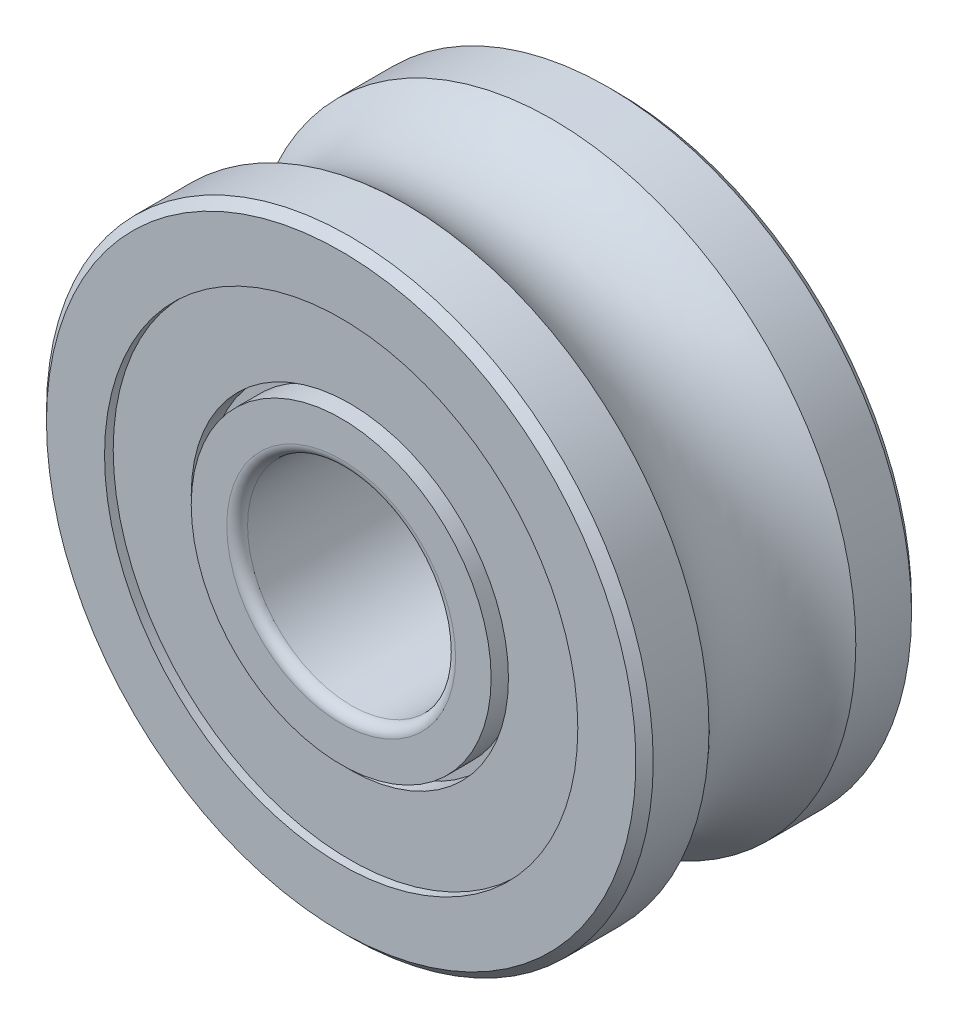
ISO-10303-21;
HEADER;
FILE_DESCRIPTION(('STEP AP214'),'2;1');
FILE_NAME('part.step','',(''),(''),'','','');
FILE_SCHEMA(('AUTOMOTIVE_DESIGN { 1 0 10303 214 1 1 1 1 }'));
ENDSEC;
DATA;
#1=APPLICATION_CONTEXT('core data for automotive mechanical design processes');
#2=APPLICATION_PROTOCOL_DEFINITION('international standard','automotive_design',2000,#1);
#3=PRODUCT_CONTEXT('',#1,'mechanical');
#4=PRODUCT('Part','Part','',(#3));
#5=PRODUCT_RELATED_PRODUCT_CATEGORY('part','',(#4));
#6=PRODUCT_DEFINITION_FORMATION('','',#4);
#7=PRODUCT_DEFINITION_CONTEXT('part definition',#1,'design');
#8=PRODUCT_DEFINITION('design','',#6,#7);
#9=PRODUCT_DEFINITION_SHAPE('','',#8);
#10=(LENGTH_UNIT() NAMED_UNIT(*) SI_UNIT(.MILLI.,.METRE.));
#11=(NAMED_UNIT(*) PLANE_ANGLE_UNIT() SI_UNIT($,.RADIAN.));
#12=(NAMED_UNIT(*) SI_UNIT($,.STERADIAN.) SOLID_ANGLE_UNIT());
#13=UNCERTAINTY_MEASURE_WITH_UNIT(LENGTH_MEASURE(1.E-05),#10,'distance_accuracy_value','');
#14=(GEOMETRIC_REPRESENTATION_CONTEXT(3) GLOBAL_UNCERTAINTY_ASSIGNED_CONTEXT((#13)) GLOBAL_UNIT_ASSIGNED_CONTEXT((#10,
#11,#12)) REPRESENTATION_CONTEXT('',''));
#15=CARTESIAN_POINT('',(0.,0.,0.));
#16=DIRECTION('',(0.,0.,1.));
#17=DIRECTION('',(1.,0.,0.));
#18=AXIS2_PLACEMENT_3D('',#15,#16,#17);
#19=CARTESIAN_POINT('',(0.,8.65,6.45));
#20=DIRECTION('',(0.,0.,-1.));
#21=DIRECTION('',(-1.,0.,0.));
#22=AXIS2_PLACEMENT_3D('',#19,#20,#21);
#23=PLANE('',#22);
#24=CARTESIAN_POINT('',(0.,0.,6.45));
#25=DIRECTION('',(0.,0.,1.));
#26=DIRECTION('',(1.,0.,0.));
#27=AXIS2_PLACEMENT_3D('',#24,#25,#26);
#28=CIRCLE('',#27,9.15);
#29=CARTESIAN_POINT('',(9.15,0.,6.45));
#30=VERTEX_POINT('',#29);
#31=EDGE_CURVE('E198',#30,#30,#28,.T.);
#32=ORIENTED_EDGE('',*,*,#31,.T.);
#33=EDGE_LOOP('',(#32));
#34=FACE_BOUND('',#33,.T.);
#35=CARTESIAN_POINT('',(0.,0.,6.45));
#36=DIRECTION('',(0.,0.,1.));
#37=DIRECTION('',(1.,0.,0.));
#38=AXIS2_PLACEMENT_3D('',#35,#36,#37);
#39=CIRCLE('',#38,8.65);
#40=CARTESIAN_POINT('',(8.65,0.,6.45));
#41=VERTEX_POINT('',#40);
#42=EDGE_CURVE('E195',#41,#41,#39,.T.);
#43=ORIENTED_EDGE('',*,*,#42,.F.);
#44=EDGE_LOOP('',(#43));
#45=FACE_BOUND('',#44,.T.);
#46=ADVANCED_FACE('F14',(#34,#45),#23,.F.);
#47=CARTESIAN_POINT('',(0.,0.,38.6779652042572));
#48=DIRECTION('',(0.,0.,1.));
#49=DIRECTION('',(1.,0.,0.));
#50=AXIS2_PLACEMENT_3D('',#47,#48,#49);
#51=CYLINDRICAL_SURFACE('',#50,8.65);
#52=CARTESIAN_POINT('',(0.,0.,7.95));
#53=DIRECTION('',(0.,0.,1.));
#54=DIRECTION('',(1.,0.,0.));
#55=AXIS2_PLACEMENT_3D('',#52,#53,#54);
#56=CIRCLE('',#55,8.65);
#57=CARTESIAN_POINT('',(8.65,0.,7.95));
#58=VERTEX_POINT('',#57);
#59=EDGE_CURVE('E201',#58,#58,#56,.F.);
#60=ORIENTED_EDGE('',*,*,#59,.T.);
#61=EDGE_LOOP('',(#60));
#62=FACE_BOUND('',#61,.T.);
#63=ORIENTED_EDGE('',*,*,#42,.T.);
#64=EDGE_LOOP('',(#63));
#65=FACE_BOUND('',#64,.T.);
#66=ADVANCED_FACE('F83',(#62,#65),#51,.T.);
#67=CARTESIAN_POINT('',(0.,0.,38.6779652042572));
#68=DIRECTION('',(0.,0.,1.));
#69=DIRECTION('',(1.,0.,0.));
#70=AXIS2_PLACEMENT_3D('',#67,#68,#69);
#71=CYLINDRICAL_SURFACE('',#70,9.15);
#72=ORIENTED_EDGE('',*,*,#31,.F.);
#73=EDGE_LOOP('',(#72));
#74=FACE_BOUND('',#73,.T.);
#75=CARTESIAN_POINT('',(0.,0.,7.45));
#76=DIRECTION('',(0.,0.,1.));
#77=DIRECTION('',(1.,0.,0.));
#78=AXIS2_PLACEMENT_3D('',#75,#76,#77);
#79=CIRCLE('',#78,9.15);
#80=CARTESIAN_POINT('',(9.15,0.,7.45));
#81=VERTEX_POINT('',#80);
#82=EDGE_CURVE('E54',#81,#81,#79,.T.);
#83=ORIENTED_EDGE('',*,*,#82,.T.);
#84=EDGE_LOOP('',(#83));
#85=FACE_BOUND('',#84,.T.);
#86=ADVANCED_FACE('F72',(#74,#85),#71,.F.);
#87=CARTESIAN_POINT('',(0.,8.65,7.95));
#88=DIRECTION('',(0.,0.,-1.));
#89=DIRECTION('',(-1.,0.,0.));
#90=AXIS2_PLACEMENT_3D('',#87,#88,#89);
#91=PLANE('',#90);
#92=ORIENTED_EDGE('',*,*,#59,.F.);
#93=EDGE_LOOP('',(#92));
#94=FACE_BOUND('',#93,.T.);
#95=CARTESIAN_POINT('',(0.,0.,7.95));
#96=DIRECTION('',(0.,0.,1.));
#97=DIRECTION('',(-1.,0.,0.));
#98=AXIS2_PLACEMENT_3D('',#95,#96,#97);
#99=CIRCLE('',#98,6.6);
#100=CARTESIAN_POINT('',(-6.6,0.,7.95));
#101=VERTEX_POINT('',#100);
#102=CARTESIAN_POINT('',(6.6,0.,7.95));
#103=VERTEX_POINT('',#102);
#104=EDGE_CURVE('E42',#101,#103,#99,.T.);
#105=ORIENTED_EDGE('',*,*,#104,.F.);
#106=CARTESIAN_POINT('',(0.,0.,7.95));
#107=DIRECTION('',(0.,0.,1.));
#108=DIRECTION('',(1.,0.,0.));
#109=AXIS2_PLACEMENT_3D('',#106,#107,#108);
#110=CIRCLE('',#109,6.6);
#111=EDGE_CURVE('E44',#103,#101,#110,.T.);
#112=ORIENTED_EDGE('',*,*,#111,.F.);
#113=EDGE_LOOP('',(#105,#112));
#114=FACE_BOUND('',#113,.T.);
#115=ADVANCED_FACE('F53',(#94,#114),#91,.F.);
#116=CARTESIAN_POINT('',(0.,13.65,7.45));
#117=DIRECTION('',(0.,0.,-1.));
#118=DIRECTION('',(-1.,0.,0.));
#119=AXIS2_PLACEMENT_3D('',#116,#117,#118);
#120=PLANE('',#119);
#121=CARTESIAN_POINT('',(0.,0.,7.45));
#122=DIRECTION('',(0.,0.,1.));
#123=DIRECTION('',(1.,0.,0.));
#124=AXIS2_PLACEMENT_3D('',#121,#122,#123);
#125=CIRCLE('',#124,13.65);
#126=CARTESIAN_POINT('',(13.65,0.,7.45));
#127=VERTEX_POINT('',#126);
#128=EDGE_CURVE('E49',#127,#127,#125,.T.);
#129=ORIENTED_EDGE('',*,*,#128,.T.);
#130=EDGE_LOOP('',(#129));
#131=FACE_BOUND('',#130,.T.);
#132=ORIENTED_EDGE('',*,*,#82,.F.);
#133=EDGE_LOOP('',(#132));
#134=FACE_BOUND('',#133,.T.);
#135=ADVANCED_FACE('F71',(#131,#134),#120,.F.);
#136=CARTESIAN_POINT('',(0.,0.,7.35));
#137=DIRECTION('',(0.,0.,1.));
#138=DIRECTION('',(1.,0.,0.));
#139=AXIS2_PLACEMENT_3D('',#136,#137,#138);
#140=TOROIDAL_SURFACE('',#139,6.6,0.6);
#141=CARTESIAN_POINT('',(0.,0.,7.35));
#142=DIRECTION('',(0.,0.,1.));
#143=DIRECTION('',(1.,0.,0.));
#144=AXIS2_PLACEMENT_3D('',#141,#142,#143);
#145=CIRCLE('',#144,6.);
#146=CARTESIAN_POINT('',(6.,0.,7.35));
#147=VERTEX_POINT('',#146);
#148=EDGE_CURVE('E207',#147,#147,#145,.F.);
#149=ORIENTED_EDGE('',*,*,#148,.T.);
#150=EDGE_LOOP('',(#149));
#151=FACE_BOUND('',#150,.T.);
#152=ORIENTED_EDGE('',*,*,#111,.T.);
#153=ORIENTED_EDGE('',*,*,#104,.T.);
#154=EDGE_LOOP('',(#152,#153));
#155=FACE_BOUND('',#154,.T.);
#156=ADVANCED_FACE('F46',(#151,#155),#140,.T.);
#157=CARTESIAN_POINT('',(0.,0.,38.6779652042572));
#158=DIRECTION('',(0.,0.,1.));
#159=DIRECTION('',(1.,0.,0.));
#160=AXIS2_PLACEMENT_3D('',#157,#158,#159);
#161=CYLINDRICAL_SURFACE('',#160,13.65);
#162=ORIENTED_EDGE('',*,*,#128,.F.);
#163=EDGE_LOOP('',(#162));
#164=FACE_BOUND('',#163,.T.);
#165=CARTESIAN_POINT('',(0.,0.,7.95));
#166=DIRECTION('',(0.,0.,1.));
#167=DIRECTION('',(1.,0.,0.));
#168=AXIS2_PLACEMENT_3D('',#165,#166,#167);
#169=CIRCLE('',#168,13.65);
#170=CARTESIAN_POINT('',(13.65,0.,7.95));
#171=VERTEX_POINT('',#170);
#172=EDGE_CURVE('E208',#171,#171,#169,.T.);
#173=ORIENTED_EDGE('',*,*,#172,.T.);
#174=EDGE_LOOP('',(#173));
#175=FACE_BOUND('',#174,.T.);
#176=ADVANCED_FACE('F240',(#164,#175),#161,.F.);
#177=CARTESIAN_POINT('',(0.,0.,38.6779652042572));
#178=DIRECTION('',(0.,0.,1.));
#179=DIRECTION('',(1.,0.,0.));
#180=AXIS2_PLACEMENT_3D('',#177,#178,#179);
#181=CYLINDRICAL_SURFACE('',#180,6.);
#182=CARTESIAN_POINT('',(0.,0.,-7.35));
#183=DIRECTION('',(0.,0.,1.));
#184=DIRECTION('',(1.,0.,0.));
#185=AXIS2_PLACEMENT_3D('',#182,#183,#184);
#186=CIRCLE('',#185,6.);
#187=CARTESIAN_POINT('',(6.,0.,-7.35));
#188=VERTEX_POINT('',#187);
#189=EDGE_CURVE('E211',#188,#188,#186,.T.);
#190=ORIENTED_EDGE('',*,*,#189,.F.);
#191=EDGE_LOOP('',(#190));
#192=FACE_BOUND('',#191,.T.);
#193=ORIENTED_EDGE('',*,*,#148,.F.);
#194=EDGE_LOOP('',(#193));
#195=FACE_BOUND('',#194,.T.);
#196=ADVANCED_FACE('F244',(#192,#195),#181,.F.);
#197=CARTESIAN_POINT('',(0.,17.,7.95));
#198=DIRECTION('',(0.,0.,-1.));
#199=DIRECTION('',(-1.,0.,0.));
#200=AXIS2_PLACEMENT_3D('',#197,#198,#199);
#201=PLANE('',#200);
#202=CARTESIAN_POINT('',(0.,0.,7.95));
#203=DIRECTION('',(0.,0.,-1.));
#204=DIRECTION('',(-1.,0.,0.));
#205=AXIS2_PLACEMENT_3D('',#202,#203,#204);
#206=CIRCLE('',#205,17.);
#207=CARTESIAN_POINT('',(-17.,0.,7.95));
#208=VERTEX_POINT('',#207);
#209=EDGE_CURVE('E212',#208,#208,#206,.T.);
#210=ORIENTED_EDGE('',*,*,#209,.F.);
#211=EDGE_LOOP('',(#210));
#212=FACE_BOUND('',#211,.T.);
#213=ORIENTED_EDGE('',*,*,#172,.F.);
#214=EDGE_LOOP('',(#213));
#215=FACE_BOUND('',#214,.T.);
#216=ADVANCED_FACE('F178',(#212,#215),#201,.F.);
#217=CARTESIAN_POINT('',(0.,0.,-7.35));
#218=DIRECTION('',(0.,0.,1.));
#219=DIRECTION('',(1.,0.,0.));
#220=AXIS2_PLACEMENT_3D('',#217,#218,#219);
#221=TOROIDAL_SURFACE('',#220,6.6,0.6);
#222=CARTESIAN_POINT('',(0.,0.,-7.95));
#223=DIRECTION('',(0.,0.,-1.));
#224=DIRECTION('',(1.,0.,0.));
#225=AXIS2_PLACEMENT_3D('',#222,#223,#224);
#226=CIRCLE('',#225,6.6);
#227=CARTESIAN_POINT('',(6.6,0.,-7.95));
#228=VERTEX_POINT('',#227);
#229=CARTESIAN_POINT('',(-6.6,0.,-7.95));
#230=VERTEX_POINT('',#229);
#231=EDGE_CURVE('E141',#228,#230,#226,.T.);
#232=ORIENTED_EDGE('',*,*,#231,.T.);
#233=CARTESIAN_POINT('',(0.,0.,-7.95));
#234=DIRECTION('',(0.,0.,-1.));
#235=DIRECTION('',(-1.,0.,0.));
#236=AXIS2_PLACEMENT_3D('',#233,#234,#235);
#237=CIRCLE('',#236,6.6);
#238=EDGE_CURVE('E33',#230,#228,#237,.T.);
#239=ORIENTED_EDGE('',*,*,#238,.T.);
#240=EDGE_LOOP('',(#232,#239));
#241=FACE_BOUND('',#240,.T.);
#242=ORIENTED_EDGE('',*,*,#189,.T.);
#243=EDGE_LOOP('',(#242));
#244=FACE_BOUND('',#243,.T.);
#245=ADVANCED_FACE('F174',(#241,#244),#221,.T.);
#246=CARTESIAN_POINT('',(0.,0.,7.45));
#247=DIRECTION('',(0.,0.,-1.));
#248=DIRECTION('',(-1.,0.,0.));
#249=AXIS2_PLACEMENT_3D('',#246,#247,#248);
#250=CONICAL_SURFACE('',#249,17.5,0.785398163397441);
#251=CARTESIAN_POINT('',(0.,0.,7.45));
#252=DIRECTION('',(0.,0.,1.));
#253=DIRECTION('',(1.,0.,0.));
#254=AXIS2_PLACEMENT_3D('',#251,#252,#253);
#255=CIRCLE('',#254,17.5);
#256=CARTESIAN_POINT('',(17.5,0.,7.45));
#257=VERTEX_POINT('',#256);
#258=EDGE_CURVE('E163',#257,#257,#255,.F.);
#259=ORIENTED_EDGE('',*,*,#258,.F.);
#260=EDGE_LOOP('',(#259));
#261=FACE_BOUND('',#260,.T.);
#262=ORIENTED_EDGE('',*,*,#209,.T.);
#263=EDGE_LOOP('',(#262));
#264=FACE_BOUND('',#263,.T.);
#265=ADVANCED_FACE('F157',(#261,#264),#250,.T.);
#266=CARTESIAN_POINT('',(0.,8.65,-7.95));
#267=DIRECTION('',(0.,0.,1.));
#268=DIRECTION('',(1.,0.,0.));
#269=AXIS2_PLACEMENT_3D('',#266,#267,#268);
#270=PLANE('',#269);
#271=ORIENTED_EDGE('',*,*,#231,.F.);
#272=ORIENTED_EDGE('',*,*,#238,.F.);
#273=EDGE_LOOP('',(#271,#272));
#274=FACE_BOUND('',#273,.T.);
#275=CARTESIAN_POINT('',(0.,0.,-7.95));
#276=DIRECTION('',(0.,0.,1.));
#277=DIRECTION('',(1.,0.,0.));
#278=AXIS2_PLACEMENT_3D('',#275,#276,#277);
#279=CIRCLE('',#278,8.65);
#280=CARTESIAN_POINT('',(8.65,0.,-7.95));
#281=VERTEX_POINT('',#280);
#282=EDGE_CURVE('E139',#281,#281,#279,.T.);
#283=ORIENTED_EDGE('',*,*,#282,.F.);
#284=EDGE_LOOP('',(#283));
#285=FACE_BOUND('',#284,.T.);
#286=ADVANCED_FACE('F146',(#274,#285),#270,.F.);
#287=CARTESIAN_POINT('',(0.,0.,38.6779652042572));
#288=DIRECTION('',(0.,0.,1.));
#289=DIRECTION('',(1.,0.,0.));
#290=AXIS2_PLACEMENT_3D('',#287,#288,#289);
#291=CYLINDRICAL_SURFACE('',#290,17.5);
#292=ORIENTED_EDGE('',*,*,#258,.T.);
#293=EDGE_LOOP('',(#292));
#294=FACE_BOUND('',#293,.T.);
#295=CARTESIAN_POINT('',(0.,0.,4.23526858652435));
#296=DIRECTION('',(0.,0.,1.));
#297=DIRECTION('',(1.,0.,0.));
#298=AXIS2_PLACEMENT_3D('',#295,#296,#297);
#299=CIRCLE('',#298,17.5);
#300=CARTESIAN_POINT('',(17.5,0.,4.23526858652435));
#301=VERTEX_POINT('',#300);
#302=EDGE_CURVE('E135',#301,#301,#299,.T.);
#303=ORIENTED_EDGE('',*,*,#302,.T.);
#304=EDGE_LOOP('',(#303));
#305=FACE_BOUND('',#304,.T.);
#306=ADVANCED_FACE('F156',(#294,#305),#291,.T.);
#307=CARTESIAN_POINT('',(0.,0.,38.6779652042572));
#308=DIRECTION('',(0.,0.,1.));
#309=DIRECTION('',(1.,0.,0.));
#310=AXIS2_PLACEMENT_3D('',#307,#308,#309);
#311=CYLINDRICAL_SURFACE('',#310,8.65);
#312=CARTESIAN_POINT('',(0.,0.,-6.45));
#313=DIRECTION('',(0.,0.,1.));
#314=DIRECTION('',(1.,0.,0.));
#315=AXIS2_PLACEMENT_3D('',#312,#313,#314);
#316=CIRCLE('',#315,8.65);
#317=CARTESIAN_POINT('',(8.65,0.,-6.45));
#318=VERTEX_POINT('',#317);
#319=EDGE_CURVE('E138',#318,#318,#316,.F.);
#320=ORIENTED_EDGE('',*,*,#319,.T.);
#321=EDGE_LOOP('',(#320));
#322=FACE_BOUND('',#321,.T.);
#323=ORIENTED_EDGE('',*,*,#282,.T.);
#324=EDGE_LOOP('',(#323));
#325=FACE_BOUND('',#324,.T.);
#326=ADVANCED_FACE('F273',(#322,#325),#311,.T.);
#327=CARTESIAN_POINT('',(0.,8.65,-6.45));
#328=DIRECTION('',(0.,0.,1.));
#329=DIRECTION('',(1.,0.,0.));
#330=AXIS2_PLACEMENT_3D('',#327,#328,#329);
#331=PLANE('',#330);
#332=ORIENTED_EDGE('',*,*,#319,.F.);
#333=EDGE_LOOP('',(#332));
#334=FACE_BOUND('',#333,.T.);
#335=CARTESIAN_POINT('',(0.,0.,-6.45));
#336=DIRECTION('',(0.,0.,1.));
#337=DIRECTION('',(1.,0.,0.));
#338=AXIS2_PLACEMENT_3D('',#335,#336,#337);
#339=CIRCLE('',#338,9.15);
#340=CARTESIAN_POINT('',(9.15,0.,-6.45));
#341=VERTEX_POINT('',#340);
#342=EDGE_CURVE('E219',#341,#341,#339,.F.);
#343=ORIENTED_EDGE('',*,*,#342,.T.);
#344=EDGE_LOOP('',(#343));
#345=FACE_BOUND('',#344,.T.);
#346=ADVANCED_FACE('F127',(#334,#345),#331,.F.);
#347=CARTESIAN_POINT('',(0.,0.,0.));
#348=DIRECTION('',(0.,0.,1.));
#349=DIRECTION('',(1.,0.,0.));
#350=AXIS2_PLACEMENT_3D('',#347,#348,#349);
#351=TOROIDAL_SURFACE('',#350,21.75,6.);
#352=ORIENTED_EDGE('',*,*,#302,.F.);
#353=EDGE_LOOP('',(#352));
#354=FACE_BOUND('',#353,.T.);
#355=CARTESIAN_POINT('',(0.,0.,-4.23526858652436));
#356=DIRECTION('',(0.,0.,1.));
#357=DIRECTION('',(1.,0.,0.));
#358=AXIS2_PLACEMENT_3D('',#355,#356,#357);
#359=CIRCLE('',#358,17.5);
#360=CARTESIAN_POINT('',(17.5,0.,-4.23526858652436));
#361=VERTEX_POINT('',#360);
#362=EDGE_CURVE('E133',#361,#361,#359,.F.);
#363=ORIENTED_EDGE('',*,*,#362,.F.);
#364=EDGE_LOOP('',(#363));
#365=FACE_BOUND('',#364,.T.);
#366=ADVANCED_FACE('F122',(#354,#365),#351,.F.);
#367=CARTESIAN_POINT('',(0.,0.,38.6779652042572));
#368=DIRECTION('',(0.,0.,1.));
#369=DIRECTION('',(1.,0.,0.));
#370=AXIS2_PLACEMENT_3D('',#367,#368,#369);
#371=CYLINDRICAL_SURFACE('',#370,9.15);
#372=CARTESIAN_POINT('',(0.,0.,-7.45));
#373=DIRECTION('',(0.,0.,1.));
#374=DIRECTION('',(1.,0.,0.));
#375=AXIS2_PLACEMENT_3D('',#372,#373,#374);
#376=CIRCLE('',#375,9.15);
#377=CARTESIAN_POINT('',(9.15,0.,-7.45));
#378=VERTEX_POINT('',#377);
#379=EDGE_CURVE('E222',#378,#378,#376,.F.);
#380=ORIENTED_EDGE('',*,*,#379,.T.);
#381=EDGE_LOOP('',(#380));
#382=FACE_BOUND('',#381,.T.);
#383=ORIENTED_EDGE('',*,*,#342,.F.);
#384=EDGE_LOOP('',(#383));
#385=FACE_BOUND('',#384,.T.);
#386=ADVANCED_FACE('F118',(#382,#385),#371,.F.);
#387=CARTESIAN_POINT('',(0.,0.,38.6779652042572));
#388=DIRECTION('',(0.,0.,1.));
#389=DIRECTION('',(1.,0.,0.));
#390=AXIS2_PLACEMENT_3D('',#387,#388,#389);
#391=CYLINDRICAL_SURFACE('',#390,17.5);
#392=ORIENTED_EDGE('',*,*,#362,.T.);
#393=EDGE_LOOP('',(#392));
#394=FACE_BOUND('',#393,.T.);
#395=CARTESIAN_POINT('',(0.,0.,-7.45));
#396=DIRECTION('',(0.,0.,1.));
#397=DIRECTION('',(1.,0.,0.));
#398=AXIS2_PLACEMENT_3D('',#395,#396,#397);
#399=CIRCLE('',#398,17.5);
#400=CARTESIAN_POINT('',(17.5,0.,-7.45));
#401=VERTEX_POINT('',#400);
#402=EDGE_CURVE('E225',#401,#401,#399,.F.);
#403=ORIENTED_EDGE('',*,*,#402,.F.);
#404=EDGE_LOOP('',(#403));
#405=FACE_BOUND('',#404,.T.);
#406=ADVANCED_FACE('F114',(#394,#405),#391,.T.);
#407=CARTESIAN_POINT('',(0.,13.65,-7.45));
#408=DIRECTION('',(0.,0.,1.));
#409=DIRECTION('',(1.,0.,0.));
#410=AXIS2_PLACEMENT_3D('',#407,#408,#409);
#411=PLANE('',#410);
#412=ORIENTED_EDGE('',*,*,#379,.F.);
#413=EDGE_LOOP('',(#412));
#414=FACE_BOUND('',#413,.T.);
#415=CARTESIAN_POINT('',(0.,0.,-7.45));
#416=DIRECTION('',(0.,0.,1.));
#417=DIRECTION('',(1.,0.,0.));
#418=AXIS2_PLACEMENT_3D('',#415,#416,#417);
#419=CIRCLE('',#418,13.65);
#420=CARTESIAN_POINT('',(13.65,0.,-7.45));
#421=VERTEX_POINT('',#420);
#422=EDGE_CURVE('E226',#421,#421,#419,.F.);
#423=ORIENTED_EDGE('',*,*,#422,.T.);
#424=EDGE_LOOP('',(#423));
#425=FACE_BOUND('',#424,.T.);
#426=ADVANCED_FACE('F110',(#414,#425),#411,.F.);
#427=CARTESIAN_POINT('',(0.,0.,-7.45));
#428=DIRECTION('',(0.,0.,1.));
#429=DIRECTION('',(1.,0.,0.));
#430=AXIS2_PLACEMENT_3D('',#427,#428,#429);
#431=CONICAL_SURFACE('',#430,17.5,0.785398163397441);
#432=ORIENTED_EDGE('',*,*,#402,.T.);
#433=EDGE_LOOP('',(#432));
#434=FACE_BOUND('',#433,.T.);
#435=CARTESIAN_POINT('',(0.,0.,-7.95));
#436=DIRECTION('',(0.,0.,1.));
#437=DIRECTION('',(1.,0.,0.));
#438=AXIS2_PLACEMENT_3D('',#435,#436,#437);
#439=CIRCLE('',#438,17.);
#440=CARTESIAN_POINT('',(17.,0.,-7.95));
#441=VERTEX_POINT('',#440);
#442=EDGE_CURVE('E25',#441,#441,#439,.T.);
#443=ORIENTED_EDGE('',*,*,#442,.T.);
#444=EDGE_LOOP('',(#443));
#445=FACE_BOUND('',#444,.T.);
#446=ADVANCED_FACE('F102',(#434,#445),#431,.T.);
#447=CARTESIAN_POINT('',(0.,0.,38.6779652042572));
#448=DIRECTION('',(0.,0.,1.));
#449=DIRECTION('',(1.,0.,0.));
#450=AXIS2_PLACEMENT_3D('',#447,#448,#449);
#451=CYLINDRICAL_SURFACE('',#450,13.65);
#452=CARTESIAN_POINT('',(0.,0.,-7.95));
#453=DIRECTION('',(0.,0.,1.));
#454=DIRECTION('',(1.,0.,0.));
#455=AXIS2_PLACEMENT_3D('',#452,#453,#454);
#456=CIRCLE('',#455,13.65);
#457=CARTESIAN_POINT('',(13.65,0.,-7.95));
#458=VERTEX_POINT('',#457);
#459=EDGE_CURVE('E9',#458,#458,#456,.F.);
#460=ORIENTED_EDGE('',*,*,#459,.T.);
#461=EDGE_LOOP('',(#460));
#462=FACE_BOUND('',#461,.T.);
#463=ORIENTED_EDGE('',*,*,#422,.F.);
#464=EDGE_LOOP('',(#463));
#465=FACE_BOUND('',#464,.T.);
#466=ADVANCED_FACE('F96',(#462,#465),#451,.F.);
#467=CARTESIAN_POINT('',(0.,17.,-7.95));
#468=DIRECTION('',(0.,0.,1.));
#469=DIRECTION('',(1.,0.,0.));
#470=AXIS2_PLACEMENT_3D('',#467,#468,#469);
#471=PLANE('',#470);
#472=ORIENTED_EDGE('',*,*,#459,.F.);
#473=EDGE_LOOP('',(#472));
#474=FACE_BOUND('',#473,.T.);
#475=ORIENTED_EDGE('',*,*,#442,.F.);
#476=EDGE_LOOP('',(#475));
#477=FACE_BOUND('',#476,.T.);
#478=ADVANCED_FACE('F94',(#474,#477),#471,.F.);
#479=CLOSED_SHELL('',(#46,#66,#86,#115,#135,#156,#176,#196,#216,#245,#265,#286,#306,#326,#346,
#366,#386,#406,#426,#446,#466,#478));
#480=MANIFOLD_SOLID_BREP('B1',#479);
#481=ADVANCED_BREP_SHAPE_REPRESENTATION('',(#18,#480),#14);
#482=SHAPE_DEFINITION_REPRESENTATION(#9,#481);
ENDSEC;
END-ISO-10303-21;
